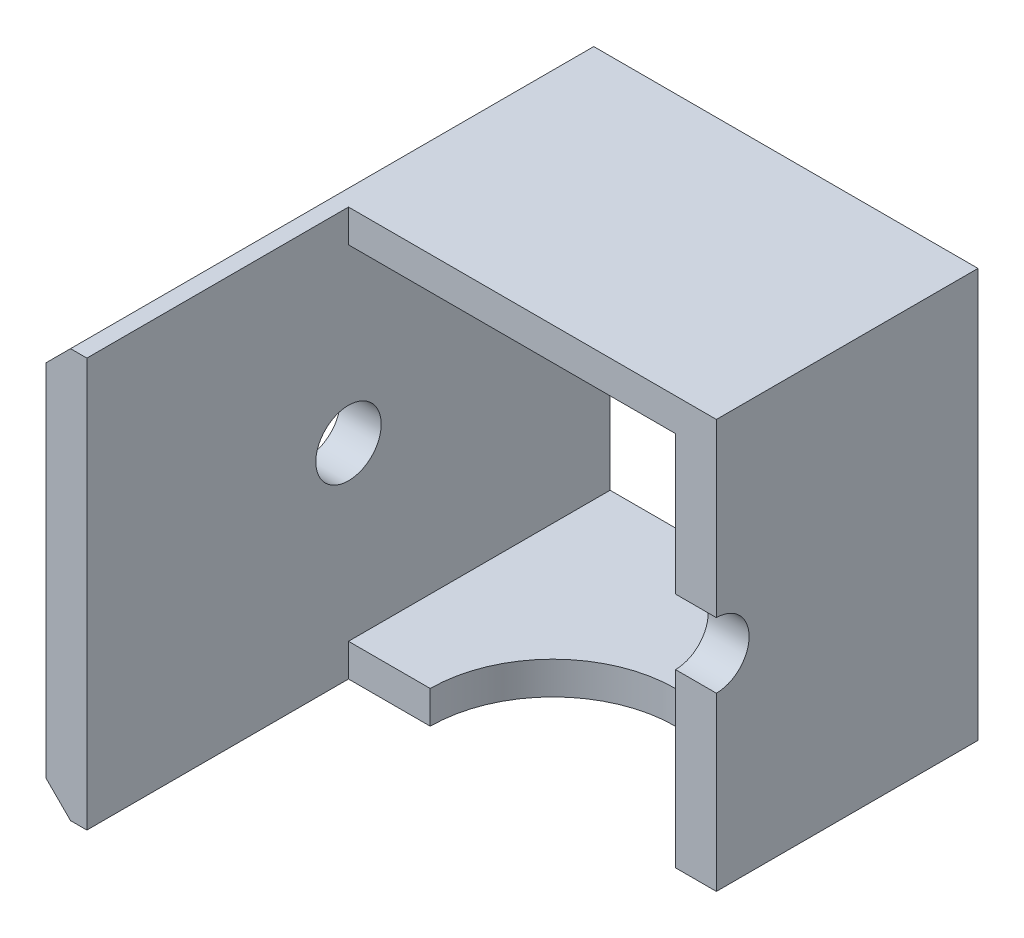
from build123d import *

# Parameters (mm, degrees)
ESQUISSE1_W             = 25
ESQUISSE1_H             = 25
ESQUISSE1_W_2           = 20
ESQUISSE1_H_2           = 21
BASE_EXTRUSION_DEPTH    = 16
CHANFREIN1_SIZE         = 1.5
ENL_V_MAT_EXTRU_1_REACH = 35.257
ESQUISSE3_R             = 7.5
ESQUISSE4_R             = 2
ENL_V_MAT_EXTRU_2_DEPTH = 33.20636583
COUPE_REACH             = 35.257
ESQUISSE5_W             = 22.5
ESQUISSE5_H             = 16


with BuildPart() as part:
    # Esquisse1 → Base-Extrusion (new, symmetric)
    with BuildSketch(Plane.XY):
        with Locations((-2.5, 0)):
            Rectangle(ESQUISSE1_W, ESQUISSE1_H)
        with Locations((-2.5, 0)):
            Rectangle(ESQUISSE1_W_2, ESQUISSE1_H_2, mode=Mode.SUBTRACT)
    extrude(amount=BASE_EXTRUSION_DEPTH, both=True)

    # Chanfrein1
    chanfrein1_edges = [part.edges().sort_by_distance(p)[0] for p in [
        (-15, 12.5, 0),
        (-15, -12.5, 0),
    ]]
    chamfer(chanfrein1_edges, length=CHANFREIN1_SIZE)

    # Esquisse3 → Enl_v. mat.-Extru.1 (cut, up to next)
    with BuildSketch(Plane.XZ.offset(12.5), mode=Mode.PRIVATE) as enl_v_mat_extru_1_sk1:
        Circle(ESQUISSE3_R)
    enl_v_mat_extru_1_tool1 = extrude(enl_v_mat_extru_1_sk1.sketch, amount=-ENL_V_MAT_EXTRU_1_REACH, mode=Mode.PRIVATE) & part.part
    add(enl_v_mat_extru_1_tool1.solids().sort_by_distance((0, -12.5, 0))[0], mode=Mode.SUBTRACT)

    # Esquisse4 → Enl_v. mat.-Extru.2 (cut, through all)
    with BuildSketch(Plane(origin=(10, 0, 0), x_dir=(0, 0, -1), z_dir=(1, 0, 0))):
        Circle(ESQUISSE4_R)
    extrude(amount=-ENL_V_MAT_EXTRU_2_DEPTH, mode=Mode.SUBTRACT)

    # Esquisse5 → COUPE (cut, up to next)
    with BuildSketch(Plane(origin=(0, 12.5, 0), x_dir=(-1, 0, 0), z_dir=(0, 1, 0)), mode=Mode.PRIVATE) as coupe_sk1:
        with Locations((1.25, 8)):
            Rectangle(ESQUISSE5_W, ESQUISSE5_H)
    coupe_tool1 = extrude(coupe_sk1.sketch, amount=-COUPE_REACH, mode=Mode.PRIVATE) & part.part
    add(coupe_tool1.solids().sort_by_distance((-1.25, 12.5, 8))[0], mode=Mode.SUBTRACT)


solid = part.part
